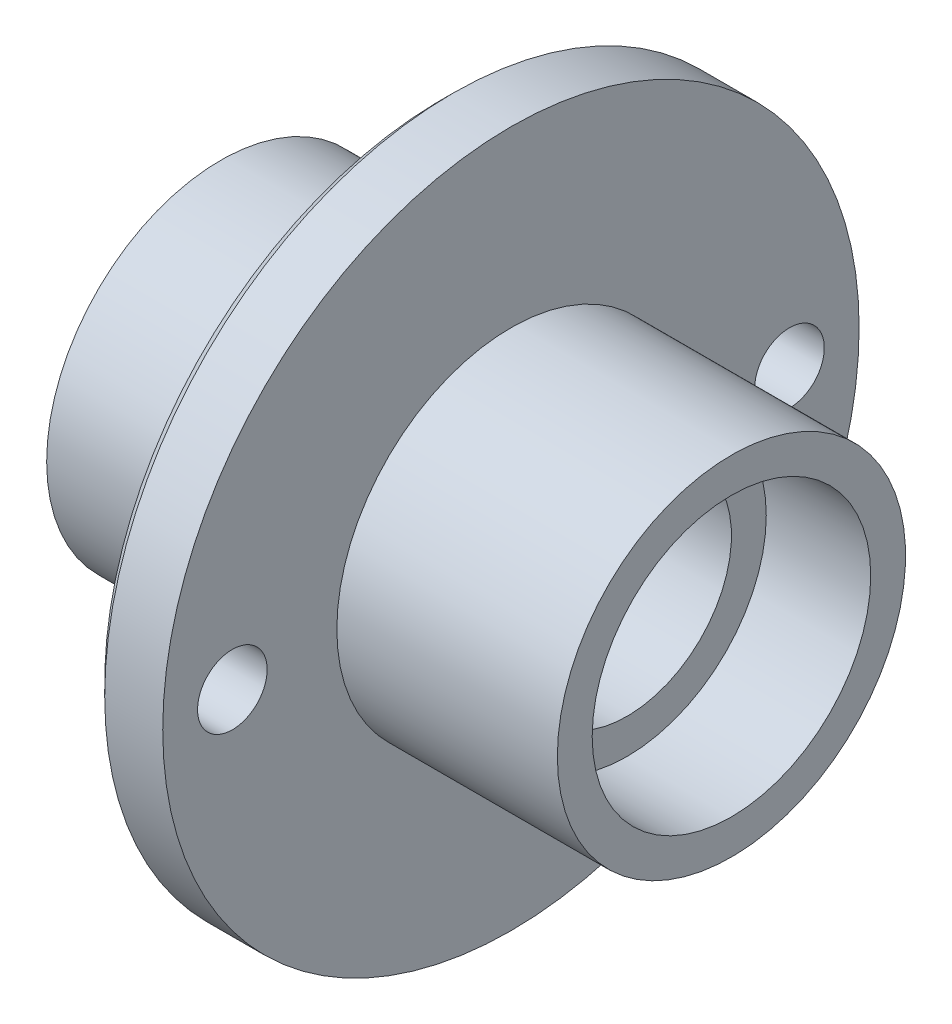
ISO-10303-21;
HEADER;
FILE_DESCRIPTION(('STEP AP214'),'2;1');
FILE_NAME('part.step','',(''),(''),'','','');
FILE_SCHEMA(('AUTOMOTIVE_DESIGN { 1 0 10303 214 1 1 1 1 }'));
ENDSEC;
DATA;
#1=APPLICATION_CONTEXT('core data for automotive mechanical design processes');
#2=APPLICATION_PROTOCOL_DEFINITION('international standard','automotive_design',2000,#1);
#3=PRODUCT_CONTEXT('',#1,'mechanical');
#4=PRODUCT('Part','Part','',(#3));
#5=PRODUCT_RELATED_PRODUCT_CATEGORY('part','',(#4));
#6=PRODUCT_DEFINITION_FORMATION('','',#4);
#7=PRODUCT_DEFINITION_CONTEXT('part definition',#1,'design');
#8=PRODUCT_DEFINITION('design','',#6,#7);
#9=PRODUCT_DEFINITION_SHAPE('','',#8);
#10=(LENGTH_UNIT() NAMED_UNIT(*) SI_UNIT(.MILLI.,.METRE.));
#11=(NAMED_UNIT(*) PLANE_ANGLE_UNIT() SI_UNIT($,.RADIAN.));
#12=(NAMED_UNIT(*) SI_UNIT($,.STERADIAN.) SOLID_ANGLE_UNIT());
#13=UNCERTAINTY_MEASURE_WITH_UNIT(LENGTH_MEASURE(1.E-05),#10,'distance_accuracy_value','');
#14=(GEOMETRIC_REPRESENTATION_CONTEXT(3) GLOBAL_UNCERTAINTY_ASSIGNED_CONTEXT((#13)) GLOBAL_UNIT_ASSIGNED_CONTEXT((#10,
#11,#12)) REPRESENTATION_CONTEXT('',''));
#15=CARTESIAN_POINT('',(0.,0.,0.));
#16=DIRECTION('',(0.,0.,1.));
#17=DIRECTION('',(1.,0.,0.));
#18=AXIS2_PLACEMENT_3D('',#15,#16,#17);
#19=CARTESIAN_POINT('',(1.5,15.,0.));
#20=DIRECTION('',(-1.,0.,0.));
#21=DIRECTION('',(0.,0.,1.));
#22=AXIS2_PLACEMENT_3D('',#19,#20,#21);
#23=PLANE('',#22);
#24=CARTESIAN_POINT('',(1.5,0.,-12.));
#25=DIRECTION('',(-1.,0.,0.));
#26=DIRECTION('',(0.,0.,1.));
#27=AXIS2_PLACEMENT_3D('',#24,#25,#26);
#28=CIRCLE('',#27,1.5);
#29=CARTESIAN_POINT('',(1.5,0.,-10.5));
#30=VERTEX_POINT('',#29);
#31=EDGE_CURVE('E85',#30,#30,#28,.T.);
#32=ORIENTED_EDGE('',*,*,#31,.T.);
#33=EDGE_LOOP('',(#32));
#34=FACE_BOUND('',#33,.T.);
#35=CARTESIAN_POINT('',(1.5,0.,12.));
#36=DIRECTION('',(-1.,0.,0.));
#37=DIRECTION('',(0.,0.,1.));
#38=AXIS2_PLACEMENT_3D('',#35,#36,#37);
#39=CIRCLE('',#38,1.5);
#40=CARTESIAN_POINT('',(1.5,0.,13.5));
#41=VERTEX_POINT('',#40);
#42=EDGE_CURVE('E79',#41,#41,#39,.T.);
#43=ORIENTED_EDGE('',*,*,#42,.T.);
#44=EDGE_LOOP('',(#43));
#45=FACE_BOUND('',#44,.T.);
#46=CARTESIAN_POINT('',(1.5,0.,0.));
#47=DIRECTION('',(-1.,0.,0.));
#48=DIRECTION('',(0.,0.,1.));
#49=AXIS2_PLACEMENT_3D('',#46,#47,#48);
#50=CIRCLE('',#49,15.);
#51=CARTESIAN_POINT('',(1.5,0.,15.));
#52=VERTEX_POINT('',#51);
#53=EDGE_CURVE('E43',#52,#52,#50,.T.);
#54=ORIENTED_EDGE('',*,*,#53,.F.);
#55=EDGE_LOOP('',(#54));
#56=FACE_BOUND('',#55,.T.);
#57=CARTESIAN_POINT('',(1.5,0.,0.));
#58=DIRECTION('',(-1.,0.,0.));
#59=DIRECTION('',(0.,0.,1.));
#60=AXIS2_PLACEMENT_3D('',#57,#58,#59);
#61=CIRCLE('',#60,7.5);
#62=CARTESIAN_POINT('',(1.5,0.,7.5));
#63=VERTEX_POINT('',#62);
#64=EDGE_CURVE('E76',#63,#63,#61,.T.);
#65=ORIENTED_EDGE('',*,*,#64,.T.);
#66=EDGE_LOOP('',(#65));
#67=FACE_BOUND('',#66,.T.);
#68=ADVANCED_FACE('F32',(#34,#45,#56,#67),#23,.F.);
#69=CARTESIAN_POINT('',(-41.5363256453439,0.,0.));
#70=DIRECTION('',(-1.,0.,0.));
#71=DIRECTION('',(0.,0.,1.));
#72=AXIS2_PLACEMENT_3D('',#69,#70,#71);
#73=CYLINDRICAL_SURFACE('',#72,15.);
#74=CARTESIAN_POINT('',(-1.00000000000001,0.,0.));
#75=DIRECTION('',(1.,0.,0.));
#76=DIRECTION('',(0.,0.,-1.));
#77=AXIS2_PLACEMENT_3D('',#74,#75,#76);
#78=CIRCLE('',#77,15.);
#79=CARTESIAN_POINT('',(-1.00000000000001,0.,-15.));
#80=VERTEX_POINT('',#79);
#81=EDGE_CURVE('E10',#80,#80,#78,.T.);
#82=ORIENTED_EDGE('',*,*,#81,.T.);
#83=EDGE_LOOP('',(#82));
#84=FACE_BOUND('',#83,.T.);
#85=ORIENTED_EDGE('',*,*,#53,.T.);
#86=EDGE_LOOP('',(#85));
#87=FACE_BOUND('',#86,.T.);
#88=ADVANCED_FACE('F98',(#84,#87),#73,.T.);
#89=CARTESIAN_POINT('',(-1.5,15.,0.));
#90=DIRECTION('',(1.,0.,0.));
#91=DIRECTION('',(0.,0.,-1.));
#92=AXIS2_PLACEMENT_3D('',#89,#90,#91);
#93=PLANE('',#92);
#94=CARTESIAN_POINT('',(-1.5,0.,-12.));
#95=DIRECTION('',(-1.,0.,0.));
#96=DIRECTION('',(0.,0.,1.));
#97=AXIS2_PLACEMENT_3D('',#94,#95,#96);
#98=CIRCLE('',#97,1.5);
#99=CARTESIAN_POINT('',(-1.5,0.,-10.5));
#100=VERTEX_POINT('',#99);
#101=EDGE_CURVE('E88',#100,#100,#98,.T.);
#102=ORIENTED_EDGE('',*,*,#101,.F.);
#103=EDGE_LOOP('',(#102));
#104=FACE_BOUND('',#103,.T.);
#105=CARTESIAN_POINT('',(-1.5,0.,12.));
#106=DIRECTION('',(-1.,0.,0.));
#107=DIRECTION('',(0.,0.,1.));
#108=AXIS2_PLACEMENT_3D('',#105,#106,#107);
#109=CIRCLE('',#108,1.5);
#110=CARTESIAN_POINT('',(-1.5,0.,13.5));
#111=VERTEX_POINT('',#110);
#112=EDGE_CURVE('E82',#111,#111,#109,.T.);
#113=ORIENTED_EDGE('',*,*,#112,.F.);
#114=EDGE_LOOP('',(#113));
#115=FACE_BOUND('',#114,.T.);
#116=CARTESIAN_POINT('',(-1.5,0.,0.));
#117=DIRECTION('',(1.,0.,0.));
#118=DIRECTION('',(0.,0.,-1.));
#119=AXIS2_PLACEMENT_3D('',#116,#117,#118);
#120=CIRCLE('',#119,14.5);
#121=CARTESIAN_POINT('',(-1.5,0.,-14.5));
#122=VERTEX_POINT('',#121);
#123=EDGE_CURVE('E39',#122,#122,#120,.F.);
#124=ORIENTED_EDGE('',*,*,#123,.T.);
#125=EDGE_LOOP('',(#124));
#126=FACE_BOUND('',#125,.T.);
#127=CARTESIAN_POINT('',(-1.49999999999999,0.,0.));
#128=DIRECTION('',(-1.,0.,0.));
#129=DIRECTION('',(0.,0.,1.));
#130=AXIS2_PLACEMENT_3D('',#127,#128,#129);
#131=CIRCLE('',#130,7.5);
#132=CARTESIAN_POINT('',(-1.49999999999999,0.,7.5));
#133=VERTEX_POINT('',#132);
#134=EDGE_CURVE('E47',#133,#133,#131,.T.);
#135=ORIENTED_EDGE('',*,*,#134,.F.);
#136=EDGE_LOOP('',(#135));
#137=FACE_BOUND('',#136,.T.);
#138=ADVANCED_FACE('F94',(#104,#115,#126,#137),#93,.F.);
#139=CARTESIAN_POINT('',(-41.5363256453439,0.,0.));
#140=DIRECTION('',(-1.,0.,0.));
#141=DIRECTION('',(0.,0.,1.));
#142=AXIS2_PLACEMENT_3D('',#139,#140,#141);
#143=CYLINDRICAL_SURFACE('',#142,7.5);
#144=CARTESIAN_POINT('',(-11.,0.,0.));
#145=DIRECTION('',(-1.,0.,0.));
#146=DIRECTION('',(0.,0.,1.));
#147=AXIS2_PLACEMENT_3D('',#144,#145,#146);
#148=CIRCLE('',#147,7.5);
#149=CARTESIAN_POINT('',(-11.,0.,7.5));
#150=VERTEX_POINT('',#149);
#151=EDGE_CURVE('E52',#150,#150,#148,.T.);
#152=ORIENTED_EDGE('',*,*,#151,.F.);
#153=EDGE_LOOP('',(#152));
#154=FACE_BOUND('',#153,.T.);
#155=ORIENTED_EDGE('',*,*,#134,.T.);
#156=EDGE_LOOP('',(#155));
#157=FACE_BOUND('',#156,.T.);
#158=ADVANCED_FACE('F97',(#154,#157),#143,.T.);
#159=CARTESIAN_POINT('',(-11.,7.5,0.));
#160=DIRECTION('',(1.,0.,0.));
#161=DIRECTION('',(0.,0.,-1.));
#162=AXIS2_PLACEMENT_3D('',#159,#160,#161);
#163=PLANE('',#162);
#164=CARTESIAN_POINT('',(-11.,0.,0.));
#165=DIRECTION('',(-1.,0.,0.));
#166=DIRECTION('',(0.,0.,1.));
#167=AXIS2_PLACEMENT_3D('',#164,#165,#166);
#168=CIRCLE('',#167,6.);
#169=CARTESIAN_POINT('',(-11.,0.,6.));
#170=VERTEX_POINT('',#169);
#171=EDGE_CURVE('E55',#170,#170,#168,.T.);
#172=ORIENTED_EDGE('',*,*,#171,.F.);
#173=EDGE_LOOP('',(#172));
#174=FACE_BOUND('',#173,.T.);
#175=ORIENTED_EDGE('',*,*,#151,.T.);
#176=EDGE_LOOP('',(#175));
#177=FACE_BOUND('',#176,.T.);
#178=ADVANCED_FACE('F105',(#174,#177),#163,.F.);
#179=CARTESIAN_POINT('',(-41.5363256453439,0.,0.));
#180=DIRECTION('',(-1.,0.,0.));
#181=DIRECTION('',(0.,0.,1.));
#182=AXIS2_PLACEMENT_3D('',#179,#180,#181);
#183=CYLINDRICAL_SURFACE('',#182,6.);
#184=CARTESIAN_POINT('',(-6.49999999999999,0.,0.));
#185=DIRECTION('',(-1.,0.,0.));
#186=DIRECTION('',(0.,0.,1.));
#187=AXIS2_PLACEMENT_3D('',#184,#185,#186);
#188=CIRCLE('',#187,6.);
#189=CARTESIAN_POINT('',(-6.49999999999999,0.,6.));
#190=VERTEX_POINT('',#189);
#191=EDGE_CURVE('E58',#190,#190,#188,.T.);
#192=ORIENTED_EDGE('',*,*,#191,.F.);
#193=EDGE_LOOP('',(#192));
#194=FACE_BOUND('',#193,.T.);
#195=ORIENTED_EDGE('',*,*,#171,.T.);
#196=EDGE_LOOP('',(#195));
#197=FACE_BOUND('',#196,.T.);
#198=ADVANCED_FACE('F111',(#194,#197),#183,.F.);
#199=CARTESIAN_POINT('',(-6.49999999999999,6.,0.));
#200=DIRECTION('',(1.,0.,0.));
#201=DIRECTION('',(0.,0.,-1.));
#202=AXIS2_PLACEMENT_3D('',#199,#200,#201);
#203=PLANE('',#202);
#204=CARTESIAN_POINT('',(-6.49999999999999,0.,0.));
#205=DIRECTION('',(-1.,0.,0.));
#206=DIRECTION('',(0.,0.,1.));
#207=AXIS2_PLACEMENT_3D('',#204,#205,#206);
#208=CIRCLE('',#207,4.5);
#209=CARTESIAN_POINT('',(-6.49999999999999,0.,4.5));
#210=VERTEX_POINT('',#209);
#211=EDGE_CURVE('E61',#210,#210,#208,.T.);
#212=ORIENTED_EDGE('',*,*,#211,.F.);
#213=EDGE_LOOP('',(#212));
#214=FACE_BOUND('',#213,.T.);
#215=ORIENTED_EDGE('',*,*,#191,.T.);
#216=EDGE_LOOP('',(#215));
#217=FACE_BOUND('',#216,.T.);
#218=ADVANCED_FACE('F156',(#214,#217),#203,.F.);
#219=CARTESIAN_POINT('',(-41.5363256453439,0.,0.));
#220=DIRECTION('',(-1.,0.,0.));
#221=DIRECTION('',(0.,0.,1.));
#222=AXIS2_PLACEMENT_3D('',#219,#220,#221);
#223=CYLINDRICAL_SURFACE('',#222,4.5);
#224=CARTESIAN_POINT('',(6.5,0.,0.));
#225=DIRECTION('',(-1.,0.,0.));
#226=DIRECTION('',(0.,0.,1.));
#227=AXIS2_PLACEMENT_3D('',#224,#225,#226);
#228=CIRCLE('',#227,4.5);
#229=CARTESIAN_POINT('',(6.5,0.,4.5));
#230=VERTEX_POINT('',#229);
#231=EDGE_CURVE('E64',#230,#230,#228,.T.);
#232=ORIENTED_EDGE('',*,*,#231,.F.);
#233=EDGE_LOOP('',(#232));
#234=FACE_BOUND('',#233,.T.);
#235=ORIENTED_EDGE('',*,*,#211,.T.);
#236=EDGE_LOOP('',(#235));
#237=FACE_BOUND('',#236,.T.);
#238=ADVANCED_FACE('F150',(#234,#237),#223,.F.);
#239=CARTESIAN_POINT('',(6.5,6.,0.));
#240=DIRECTION('',(-1.,0.,0.));
#241=DIRECTION('',(0.,0.,1.));
#242=AXIS2_PLACEMENT_3D('',#239,#240,#241);
#243=PLANE('',#242);
#244=CARTESIAN_POINT('',(6.5,0.,0.));
#245=DIRECTION('',(-1.,0.,0.));
#246=DIRECTION('',(0.,0.,1.));
#247=AXIS2_PLACEMENT_3D('',#244,#245,#246);
#248=CIRCLE('',#247,6.);
#249=CARTESIAN_POINT('',(6.5,0.,6.));
#250=VERTEX_POINT('',#249);
#251=EDGE_CURVE('E67',#250,#250,#248,.T.);
#252=ORIENTED_EDGE('',*,*,#251,.F.);
#253=EDGE_LOOP('',(#252));
#254=FACE_BOUND('',#253,.T.);
#255=ORIENTED_EDGE('',*,*,#231,.T.);
#256=EDGE_LOOP('',(#255));
#257=FACE_BOUND('',#256,.T.);
#258=ADVANCED_FACE('F144',(#254,#257),#243,.F.);
#259=CARTESIAN_POINT('',(-41.5363256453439,0.,0.));
#260=DIRECTION('',(-1.,0.,0.));
#261=DIRECTION('',(0.,0.,1.));
#262=AXIS2_PLACEMENT_3D('',#259,#260,#261);
#263=CYLINDRICAL_SURFACE('',#262,6.);
#264=CARTESIAN_POINT('',(11.,0.,0.));
#265=DIRECTION('',(-1.,0.,0.));
#266=DIRECTION('',(0.,0.,1.));
#267=AXIS2_PLACEMENT_3D('',#264,#265,#266);
#268=CIRCLE('',#267,6.);
#269=CARTESIAN_POINT('',(11.,0.,6.));
#270=VERTEX_POINT('',#269);
#271=EDGE_CURVE('E70',#270,#270,#268,.T.);
#272=ORIENTED_EDGE('',*,*,#271,.F.);
#273=EDGE_LOOP('',(#272));
#274=FACE_BOUND('',#273,.T.);
#275=ORIENTED_EDGE('',*,*,#251,.T.);
#276=EDGE_LOOP('',(#275));
#277=FACE_BOUND('',#276,.T.);
#278=ADVANCED_FACE('F138',(#274,#277),#263,.F.);
#279=CARTESIAN_POINT('',(11.,7.5,0.));
#280=DIRECTION('',(-1.,0.,0.));
#281=DIRECTION('',(0.,0.,1.));
#282=AXIS2_PLACEMENT_3D('',#279,#280,#281);
#283=PLANE('',#282);
#284=CARTESIAN_POINT('',(11.,0.,0.));
#285=DIRECTION('',(-1.,0.,0.));
#286=DIRECTION('',(0.,0.,1.));
#287=AXIS2_PLACEMENT_3D('',#284,#285,#286);
#288=CIRCLE('',#287,7.5);
#289=CARTESIAN_POINT('',(11.,0.,7.5));
#290=VERTEX_POINT('',#289);
#291=EDGE_CURVE('E73',#290,#290,#288,.T.);
#292=ORIENTED_EDGE('',*,*,#291,.F.);
#293=EDGE_LOOP('',(#292));
#294=FACE_BOUND('',#293,.T.);
#295=ORIENTED_EDGE('',*,*,#271,.T.);
#296=EDGE_LOOP('',(#295));
#297=FACE_BOUND('',#296,.T.);
#298=ADVANCED_FACE('F132',(#294,#297),#283,.F.);
#299=CARTESIAN_POINT('',(-41.5363256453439,0.,0.));
#300=DIRECTION('',(-1.,0.,0.));
#301=DIRECTION('',(0.,0.,1.));
#302=AXIS2_PLACEMENT_3D('',#299,#300,#301);
#303=CYLINDRICAL_SURFACE('',#302,7.5);
#304=ORIENTED_EDGE('',*,*,#64,.F.);
#305=EDGE_LOOP('',(#304));
#306=FACE_BOUND('',#305,.T.);
#307=ORIENTED_EDGE('',*,*,#291,.T.);
#308=EDGE_LOOP('',(#307));
#309=FACE_BOUND('',#308,.T.);
#310=ADVANCED_FACE('F129',(#306,#309),#303,.T.);
#311=CARTESIAN_POINT('',(-1.49999999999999,0.,0.));
#312=DIRECTION('',(1.,0.,0.));
#313=DIRECTION('',(0.,0.,-1.));
#314=AXIS2_PLACEMENT_3D('',#311,#312,#313);
#315=CONICAL_SURFACE('',#314,14.5,0.785398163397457);
#316=ORIENTED_EDGE('',*,*,#81,.F.);
#317=EDGE_LOOP('',(#316));
#318=FACE_BOUND('',#317,.T.);
#319=ORIENTED_EDGE('',*,*,#123,.F.);
#320=EDGE_LOOP('',(#319));
#321=FACE_BOUND('',#320,.T.);
#322=ADVANCED_FACE('F34',(#318,#321),#315,.T.);
#323=CARTESIAN_POINT('',(-1.5,0.,12.));
#324=DIRECTION('',(-1.,0.,0.));
#325=DIRECTION('',(0.,0.,1.));
#326=AXIS2_PLACEMENT_3D('',#323,#324,#325);
#327=CYLINDRICAL_SURFACE('',#326,1.5);
#328=ORIENTED_EDGE('',*,*,#42,.F.);
#329=EDGE_LOOP('',(#328));
#330=FACE_BOUND('',#329,.T.);
#331=ORIENTED_EDGE('',*,*,#112,.T.);
#332=EDGE_LOOP('',(#331));
#333=FACE_BOUND('',#332,.T.);
#334=ADVANCED_FACE('F173',(#330,#333),#327,.F.);
#335=CARTESIAN_POINT('',(-1.5,0.,-12.));
#336=DIRECTION('',(-1.,0.,0.));
#337=DIRECTION('',(0.,0.,1.));
#338=AXIS2_PLACEMENT_3D('',#335,#336,#337);
#339=CYLINDRICAL_SURFACE('',#338,1.5);
#340=ORIENTED_EDGE('',*,*,#31,.F.);
#341=EDGE_LOOP('',(#340));
#342=FACE_BOUND('',#341,.T.);
#343=ORIENTED_EDGE('',*,*,#101,.T.);
#344=EDGE_LOOP('',(#343));
#345=FACE_BOUND('',#344,.T.);
#346=ADVANCED_FACE('F92',(#342,#345),#339,.F.);
#347=CLOSED_SHELL('',(#68,#88,#138,#158,#178,#198,#218,#238,#258,#278,#298,#310,#322,#334,#346));
#348=MANIFOLD_SOLID_BREP('B2',#347);
#349=ADVANCED_BREP_SHAPE_REPRESENTATION('',(#18,#348),#14);
#350=SHAPE_DEFINITION_REPRESENTATION(#9,#349);
ENDSEC;
END-ISO-10303-21;
